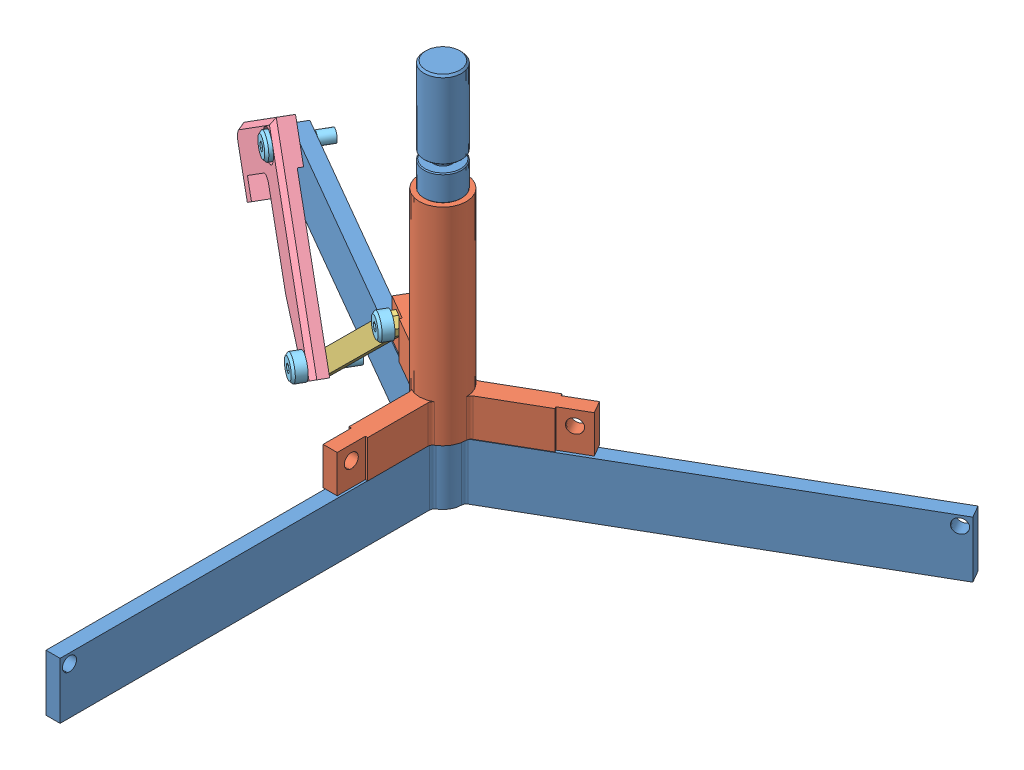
SolidWorks assembly claw-mechanism1.SLDASM, configuration Default (file format 4100). Lengths in mm.
Overall size (517.37 355.74 419.93).
11 component instances, 5 part files, 6 mates.
Components (placement in the parent):
- claw-mechanism-1: claw-mechanism.sldasm [Default] at (-51.4895 47.5415 -5.1287) size (517.37 355.74 419.93)
  - center-1: center.SLDPRT [Default] at origin size (461.2 254 399.41)
  - collar-1: collar.sldprt [Default] at (0 39.5529 0) size (136.74 139.7 118.42)
  - con-rod-1: con-rod.SLDPRT [Default] at (-59.5556 64.3842 -28.8852) x (-0.65545 -0.65359 -0.378424) z (-0.5 0 0.866025) size (177.8 12.7 3.17)
  - claw-1: claw.sldprt [Default] at (-231.4513 31.75 -113.4645) x (-0.511283 0.807126 -0.295189) z (0.5 0 -0.866025) size (127 82.55 12.7)
  - pin-1: pin.sldprt [Default] at (-61.711 55.4279 -26.4634) x (0.86382 -0.071327 0.498727) z (-0.061771 -0.997453 -0.035663) (suppressed, hidden)
  - pin-2: pin.sldprt [Default] at (-229.2288 31.75 -117.314) x (-0.287599 -0.943247 -0.166045) z (-0.816876 0.332091 -0.471624) (suppressed, hidden)
  - pin-3: pin.sldprt [Default] at (-174.6884 -52.4798 -80.6924) x (-0.530785 -0.790162 -0.306449) z (-0.684301 0.612897 -0.395081) (suppressed, hidden)
- pin-1: pin.sldprt [Default] at (-113.2005 102.9694 -31.5921) x (0.75 0.5 0.433013) z (0.433013 -0.866025 0.25)
- pin-2: pin.sldprt [Default] at (-280.7183 79.2915 -122.4427) x (0.799352 0.38477 0.461506) z (0.333221 -0.923012 0.192385)
- pin-3: pin.sldprt [Default] at (-226.1779 -4.9383 -85.8211) x (0.75 0.5 0.433013) z (0.433013 -0.866025 0.25)
Mates (geometry in assembly coordinates):
- Concentric3: concentric anti-aligned: cylinder of claw-mechanism-1/collar-1 through (-73.8549 102.9694 -99.7406) axis (-0.5 0 0.866025) radius 4.7625; cylinder of pin-1 through (-113.2005 102.9694 -31.5921) axis (0.5 0 -0.866025) radius 4.7625
- Coincident2: coincident anti-aligned: plane of claw-mechanism-1/con-rod-1 through (-105.4441 102.3137 -27.1139) normal (-0.5 0 0.866025); plane of pin-1 through (-113.2005 102.9694 -31.5921) normal (0.5 0 -0.866025)
- Concentric4: concentric anti-aligned: cylinder of claw-mechanism-1/center-1 through (-157.7187 79.2915 -335.4844) axis (-0.5 0 0.866025) radius 4.7625; cylinder of pin-2 through (-280.7183 79.2915 -122.4427) axis (0.5 0 -0.866025) radius 4.7625
- Coincident3: coincident anti-aligned: plane of claw-mechanism-1/claw-1 through (-280.7183 79.2915 -122.4427) normal (-0.5 0 0.866025); plane of pin-2 through (-280.7183 79.2915 -122.4427) normal (0.5 0 -0.866025)
- Coincident5: coincident anti-aligned: circle of claw-mechanism-1/claw-1; cylinder of pin-3 through (-226.1779 -4.9383 -85.8211) axis (0.5 0 -0.866025) radius 4.7625
- Coincident6: coincident anti-aligned: plane of claw-mechanism-1/claw-1 through (-233.3784 -20.4609 -89.9783) normal (-0.5 0 0.866025); plane of pin-3 through (-226.1779 -4.9383 -85.8211) normal (0.5 0 -0.866025)
